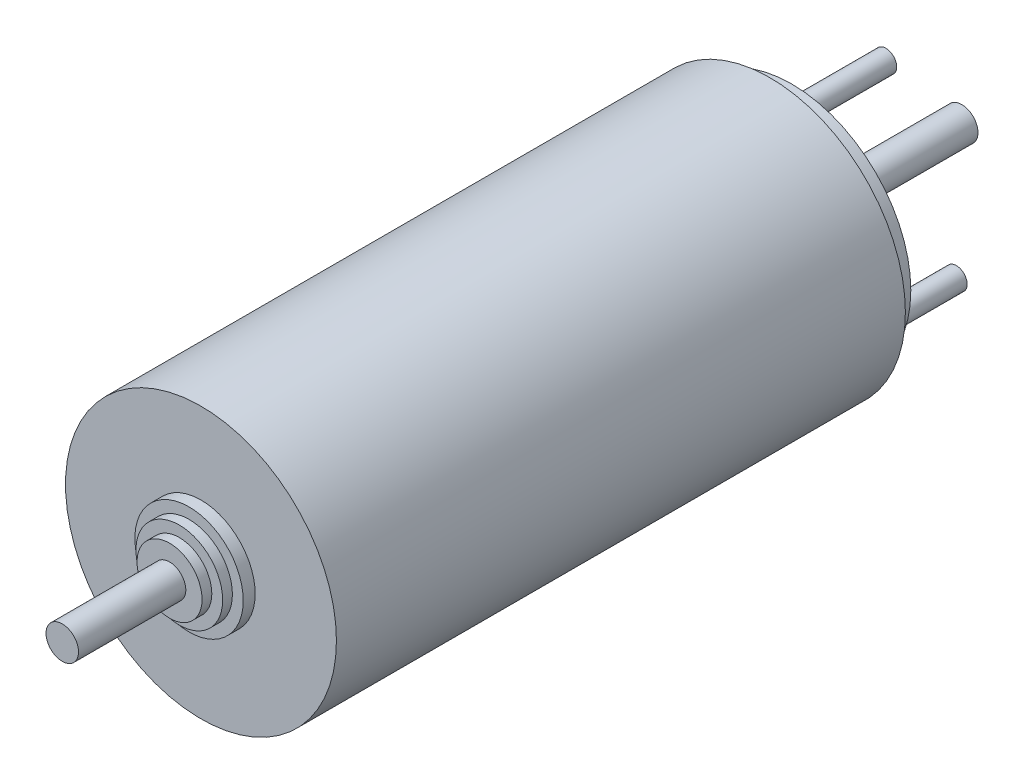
ISO-10303-21;
HEADER;
FILE_DESCRIPTION(('STEP AP214'),'2;1');
FILE_NAME('part.step','',(''),(''),'','','');
FILE_SCHEMA(('AUTOMOTIVE_DESIGN { 1 0 10303 214 1 1 1 1 }'));
ENDSEC;
DATA;
#1=APPLICATION_CONTEXT('core data for automotive mechanical design processes');
#2=APPLICATION_PROTOCOL_DEFINITION('international standard','automotive_design',2000,#1);
#3=PRODUCT_CONTEXT('',#1,'mechanical');
#4=PRODUCT('Part','Part','',(#3));
#5=PRODUCT_RELATED_PRODUCT_CATEGORY('part','',(#4));
#6=PRODUCT_DEFINITION_FORMATION('','',#4);
#7=PRODUCT_DEFINITION_CONTEXT('part definition',#1,'design');
#8=PRODUCT_DEFINITION('design','',#6,#7);
#9=PRODUCT_DEFINITION_SHAPE('','',#8);
#10=(LENGTH_UNIT() NAMED_UNIT(*) SI_UNIT(.MILLI.,.METRE.));
#11=(NAMED_UNIT(*) PLANE_ANGLE_UNIT() SI_UNIT($,.RADIAN.));
#12=(NAMED_UNIT(*) SI_UNIT($,.STERADIAN.) SOLID_ANGLE_UNIT());
#13=UNCERTAINTY_MEASURE_WITH_UNIT(LENGTH_MEASURE(1.E-05),#10,'distance_accuracy_value','');
#14=(GEOMETRIC_REPRESENTATION_CONTEXT(3) GLOBAL_UNCERTAINTY_ASSIGNED_CONTEXT((#13)) GLOBAL_UNIT_ASSIGNED_CONTEXT((#10,
#11,#12)) REPRESENTATION_CONTEXT('',''));
#15=CARTESIAN_POINT('',(0.,0.,0.));
#16=DIRECTION('',(0.,0.,1.));
#17=DIRECTION('',(1.,0.,0.));
#18=AXIS2_PLACEMENT_3D('',#15,#16,#17);
#19=CARTESIAN_POINT('',(-5.37038509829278,6.89725929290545,-2.));
#20=DIRECTION('',(0.,0.,-1.));
#21=DIRECTION('',(-1.,0.,0.));
#22=AXIS2_PLACEMENT_3D('',#19,#20,#21);
#23=PLANE('',#22);
#24=CARTESIAN_POINT('',(-11.8705642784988,1.28084960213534,-2.));
#25=DIRECTION('',(0.,0.,-1.));
#26=DIRECTION('',(-1.,0.,0.));
#27=AXIS2_PLACEMENT_3D('',#24,#25,#26);
#28=CIRCLE('',#27,1.);
#29=CARTESIAN_POINT('',(-12.8705642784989,1.28084960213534,-2.));
#30=VERTEX_POINT('',#29);
#31=EDGE_CURVE('E100',#30,#30,#28,.T.);
#32=ORIENTED_EDGE('',*,*,#31,.F.);
#33=EDGE_LOOP('',(#32));
#34=FACE_BOUND('',#33,.T.);
#35=CARTESIAN_POINT('',(-5.37038509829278,6.89725929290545,-2.));
#36=DIRECTION('',(0.,0.,-1.));
#37=DIRECTION('',(-1.,0.,0.));
#38=AXIS2_PLACEMENT_3D('',#35,#36,#37);
#39=CIRCLE('',#38,4.);
#40=CARTESIAN_POINT('',(-1.37038509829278,6.89725929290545,-2.));
#41=VERTEX_POINT('',#40);
#42=EDGE_CURVE('E76',#41,#41,#39,.T.);
#43=ORIENTED_EDGE('',*,*,#42,.F.);
#44=EDGE_LOOP('',(#43));
#45=FACE_BOUND('',#44,.T.);
#46=CARTESIAN_POINT('',(-5.37038509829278,6.89725929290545,-2.));
#47=DIRECTION('',(0.,0.,-1.));
#48=DIRECTION('',(-1.,0.,0.));
#49=AXIS2_PLACEMENT_3D('',#46,#47,#48);
#50=CIRCLE('',#49,11.);
#51=CARTESIAN_POINT('',(-16.3703850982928,6.89725929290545,-2.));
#52=VERTEX_POINT('',#51);
#53=EDGE_CURVE('E70',#52,#52,#50,.T.);
#54=ORIENTED_EDGE('',*,*,#53,.T.);
#55=EDGE_LOOP('',(#54));
#56=FACE_BOUND('',#55,.T.);
#57=CARTESIAN_POINT('',(-5.37056427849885,15.3972592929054,-2.));
#58=DIRECTION('',(0.,0.,-1.));
#59=DIRECTION('',(-1.,0.,0.));
#60=AXIS2_PLACEMENT_3D('',#57,#58,#59);
#61=CIRCLE('',#60,1.);
#62=CARTESIAN_POINT('',(-6.37056427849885,15.3972592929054,-2.));
#63=VERTEX_POINT('',#62);
#64=EDGE_CURVE('E94',#63,#63,#61,.T.);
#65=ORIENTED_EDGE('',*,*,#64,.F.);
#66=EDGE_LOOP('',(#65));
#67=FACE_BOUND('',#66,.T.);
#68=CARTESIAN_POINT('',(1.12943572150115,1.28084960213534,-2.));
#69=DIRECTION('',(0.,0.,-1.));
#70=DIRECTION('',(-1.,0.,0.));
#71=AXIS2_PLACEMENT_3D('',#68,#69,#70);
#72=CIRCLE('',#71,1.);
#73=CARTESIAN_POINT('',(0.129435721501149,1.28084960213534,-2.));
#74=VERTEX_POINT('',#73);
#75=EDGE_CURVE('E106',#74,#74,#72,.T.);
#76=ORIENTED_EDGE('',*,*,#75,.F.);
#77=EDGE_LOOP('',(#76));
#78=FACE_BOUND('',#77,.T.);
#79=ADVANCED_FACE('F31',(#34,#45,#56,#67,#78),#23,.T.);
#80=CARTESIAN_POINT('',(-5.37038509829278,6.89725929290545,-4.7));
#81=DIRECTION('',(0.,0.,-1.));
#82=DIRECTION('',(-1.,0.,0.));
#83=AXIS2_PLACEMENT_3D('',#80,#81,#82);
#84=PLANE('',#83);
#85=CARTESIAN_POINT('',(-5.37038509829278,6.89725929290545,-4.7));
#86=DIRECTION('',(0.,0.,-1.));
#87=DIRECTION('',(-1.,0.,0.));
#88=AXIS2_PLACEMENT_3D('',#85,#86,#87);
#89=CIRCLE('',#88,3.);
#90=CARTESIAN_POINT('',(-2.37038509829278,6.89725929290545,-4.7));
#91=VERTEX_POINT('',#90);
#92=EDGE_CURVE('E79',#91,#91,#89,.T.);
#93=ORIENTED_EDGE('',*,*,#92,.T.);
#94=EDGE_LOOP('',(#93));
#95=FACE_BOUND('',#94,.T.);
#96=CARTESIAN_POINT('',(-5.37038509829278,6.89725929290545,-4.7));
#97=DIRECTION('',(0.,0.,-1.));
#98=DIRECTION('',(-1.,0.,0.));
#99=AXIS2_PLACEMENT_3D('',#96,#97,#98);
#100=CIRCLE('',#99,1.5);
#101=CARTESIAN_POINT('',(-3.87038509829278,6.89725929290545,-4.7));
#102=VERTEX_POINT('',#101);
#103=EDGE_CURVE('E88',#102,#102,#100,.T.);
#104=ORIENTED_EDGE('',*,*,#103,.F.);
#105=EDGE_LOOP('',(#104));
#106=FACE_BOUND('',#105,.T.);
#107=ADVANCED_FACE('F122',(#95,#106),#84,.T.);
#108=CARTESIAN_POINT('',(-5.37038509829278,6.89725929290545,-3.35));
#109=DIRECTION('',(0.,0.,-1.));
#110=DIRECTION('',(-1.,0.,0.));
#111=AXIS2_PLACEMENT_3D('',#108,#109,#110);
#112=PLANE('',#111);
#113=CARTESIAN_POINT('',(-5.37038509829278,6.89725929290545,-3.35));
#114=DIRECTION('',(0.,0.,-1.));
#115=DIRECTION('',(-1.,0.,0.));
#116=AXIS2_PLACEMENT_3D('',#113,#114,#115);
#117=CIRCLE('',#116,4.);
#118=CARTESIAN_POINT('',(-1.37038509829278,6.89725929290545,-3.35));
#119=VERTEX_POINT('',#118);
#120=EDGE_CURVE('E75',#119,#119,#117,.T.);
#121=ORIENTED_EDGE('',*,*,#120,.T.);
#122=EDGE_LOOP('',(#121));
#123=FACE_BOUND('',#122,.T.);
#124=CARTESIAN_POINT('',(-5.37038509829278,6.89725929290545,-3.35));
#125=DIRECTION('',(0.,0.,-1.));
#126=DIRECTION('',(-1.,0.,0.));
#127=AXIS2_PLACEMENT_3D('',#124,#125,#126);
#128=CIRCLE('',#127,3.);
#129=CARTESIAN_POINT('',(-2.37038509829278,6.89725929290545,-3.35));
#130=VERTEX_POINT('',#129);
#131=EDGE_CURVE('E82',#130,#130,#128,.T.);
#132=ORIENTED_EDGE('',*,*,#131,.F.);
#133=EDGE_LOOP('',(#132));
#134=FACE_BOUND('',#133,.T.);
#135=ADVANCED_FACE('F128',(#123,#134),#112,.T.);
#136=CARTESIAN_POINT('',(-5.37038509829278,6.89725929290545,0.));
#137=DIRECTION('',(0.,0.,1.));
#138=DIRECTION('',(1.,0.,0.));
#139=AXIS2_PLACEMENT_3D('',#136,#137,#138);
#140=PLANE('',#139);
#141=CARTESIAN_POINT('',(-5.37038509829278,6.89725929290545,0.));
#142=DIRECTION('',(0.,0.,1.));
#143=DIRECTION('',(1.,0.,0.));
#144=AXIS2_PLACEMENT_3D('',#141,#142,#143);
#145=CIRCLE('',#144,12.5);
#146=CARTESIAN_POINT('',(7.12961490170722,6.89725929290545,0.));
#147=VERTEX_POINT('',#146);
#148=EDGE_CURVE('E42',#147,#147,#145,.T.);
#149=ORIENTED_EDGE('',*,*,#148,.F.);
#150=EDGE_LOOP('',(#149));
#151=FACE_BOUND('',#150,.T.);
#152=CARTESIAN_POINT('',(-5.37038509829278,6.89725929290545,0.));
#153=DIRECTION('',(0.,0.,1.));
#154=DIRECTION('',(1.,0.,0.));
#155=AXIS2_PLACEMENT_3D('',#152,#153,#154);
#156=CIRCLE('',#155,11.);
#157=CARTESIAN_POINT('',(5.62961490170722,6.89725929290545,0.));
#158=VERTEX_POINT('',#157);
#159=EDGE_CURVE('E10',#158,#158,#156,.F.);
#160=ORIENTED_EDGE('',*,*,#159,.F.);
#161=EDGE_LOOP('',(#160));
#162=FACE_BOUND('',#161,.T.);
#163=ADVANCED_FACE('F154',(#151,#162),#140,.F.);
#164=CARTESIAN_POINT('',(-5.37038509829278,6.89725929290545,55.4));
#165=DIRECTION('',(0.,0.,1.));
#166=DIRECTION('',(1.,0.,0.));
#167=AXIS2_PLACEMENT_3D('',#164,#165,#166);
#168=PLANE('',#167);
#169=CARTESIAN_POINT('',(-5.37038509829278,6.89725929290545,55.4));
#170=DIRECTION('',(0.,0.,1.));
#171=DIRECTION('',(1.,0.,0.));
#172=AXIS2_PLACEMENT_3D('',#169,#170,#171);
#173=CIRCLE('',#172,3.);
#174=CARTESIAN_POINT('',(-2.37038509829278,6.89725929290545,55.4));
#175=VERTEX_POINT('',#174);
#176=EDGE_CURVE('E58',#175,#175,#173,.T.);
#177=ORIENTED_EDGE('',*,*,#176,.T.);
#178=EDGE_LOOP('',(#177));
#179=FACE_BOUND('',#178,.T.);
#180=CARTESIAN_POINT('',(-5.37038509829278,6.89725929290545,55.4));
#181=DIRECTION('',(0.,0.,1.));
#182=DIRECTION('',(1.,0.,0.));
#183=AXIS2_PLACEMENT_3D('',#180,#181,#182);
#184=CIRCLE('',#183,1.5);
#185=CARTESIAN_POINT('',(-6.87038509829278,6.89725929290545,55.4));
#186=VERTEX_POINT('',#185);
#187=EDGE_CURVE('E67',#186,#186,#184,.T.);
#188=ORIENTED_EDGE('',*,*,#187,.F.);
#189=EDGE_LOOP('',(#188));
#190=FACE_BOUND('',#189,.T.);
#191=ADVANCED_FACE('F150',(#179,#190),#168,.T.);
#192=CARTESIAN_POINT('',(-5.37038509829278,6.89725929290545,54.5));
#193=DIRECTION('',(0.,0.,1.));
#194=DIRECTION('',(1.,0.,0.));
#195=AXIS2_PLACEMENT_3D('',#192,#193,#194);
#196=PLANE('',#195);
#197=CARTESIAN_POINT('',(-5.37038509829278,6.89725929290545,54.5));
#198=DIRECTION('',(0.,0.,1.));
#199=DIRECTION('',(1.,0.,0.));
#200=AXIS2_PLACEMENT_3D('',#197,#198,#199);
#201=CIRCLE('',#200,4.);
#202=CARTESIAN_POINT('',(-1.37038509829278,6.89725929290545,54.5));
#203=VERTEX_POINT('',#202);
#204=EDGE_CURVE('E52',#203,#203,#201,.T.);
#205=ORIENTED_EDGE('',*,*,#204,.T.);
#206=EDGE_LOOP('',(#205));
#207=FACE_BOUND('',#206,.T.);
#208=CARTESIAN_POINT('',(-5.37038509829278,6.89725929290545,54.5));
#209=DIRECTION('',(0.,0.,1.));
#210=DIRECTION('',(1.,0.,0.));
#211=AXIS2_PLACEMENT_3D('',#208,#209,#210);
#212=CIRCLE('',#211,3.);
#213=CARTESIAN_POINT('',(-2.37038509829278,6.89725929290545,54.5));
#214=VERTEX_POINT('',#213);
#215=EDGE_CURVE('E61',#214,#214,#212,.T.);
#216=ORIENTED_EDGE('',*,*,#215,.F.);
#217=EDGE_LOOP('',(#216));
#218=FACE_BOUND('',#217,.T.);
#219=ADVANCED_FACE('F153',(#207,#218),#196,.T.);
#220=CARTESIAN_POINT('',(-5.37038509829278,6.89725929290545,53.6));
#221=DIRECTION('',(0.,0.,1.));
#222=DIRECTION('',(1.,0.,0.));
#223=AXIS2_PLACEMENT_3D('',#220,#221,#222);
#224=PLANE('',#223);
#225=CARTESIAN_POINT('',(-5.37038509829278,6.89725929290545,53.6));
#226=DIRECTION('',(0.,0.,1.));
#227=DIRECTION('',(1.,0.,0.));
#228=AXIS2_PLACEMENT_3D('',#225,#226,#227);
#229=CIRCLE('',#228,5.);
#230=CARTESIAN_POINT('',(-0.370385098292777,6.89725929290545,53.6));
#231=VERTEX_POINT('',#230);
#232=EDGE_CURVE('E47',#231,#231,#229,.T.);
#233=ORIENTED_EDGE('',*,*,#232,.T.);
#234=EDGE_LOOP('',(#233));
#235=FACE_BOUND('',#234,.T.);
#236=CARTESIAN_POINT('',(-5.37038509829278,6.89725929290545,53.6));
#237=DIRECTION('',(0.,0.,1.));
#238=DIRECTION('',(1.,0.,0.));
#239=AXIS2_PLACEMENT_3D('',#236,#237,#238);
#240=CIRCLE('',#239,4.);
#241=CARTESIAN_POINT('',(-1.37038509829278,6.89725929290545,53.6));
#242=VERTEX_POINT('',#241);
#243=EDGE_CURVE('E55',#242,#242,#240,.T.);
#244=ORIENTED_EDGE('',*,*,#243,.F.);
#245=EDGE_LOOP('',(#244));
#246=FACE_BOUND('',#245,.T.);
#247=ADVANCED_FACE('F162',(#235,#246),#224,.T.);
#248=CARTESIAN_POINT('',(-5.37038509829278,6.89725929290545,52.5));
#249=DIRECTION('',(0.,0.,1.));
#250=DIRECTION('',(1.,0.,0.));
#251=AXIS2_PLACEMENT_3D('',#248,#249,#250);
#252=PLANE('',#251);
#253=CARTESIAN_POINT('',(-5.37038509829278,6.89725929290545,52.5));
#254=DIRECTION('',(0.,0.,1.));
#255=DIRECTION('',(1.,0.,0.));
#256=AXIS2_PLACEMENT_3D('',#253,#254,#255);
#257=CIRCLE('',#256,12.5);
#258=CARTESIAN_POINT('',(7.12961490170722,6.89725929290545,52.5));
#259=VERTEX_POINT('',#258);
#260=EDGE_CURVE('E38',#259,#259,#257,.T.);
#261=ORIENTED_EDGE('',*,*,#260,.T.);
#262=EDGE_LOOP('',(#261));
#263=FACE_BOUND('',#262,.T.);
#264=CARTESIAN_POINT('',(-5.37038509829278,6.89725929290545,52.5));
#265=DIRECTION('',(0.,0.,1.));
#266=DIRECTION('',(1.,0.,0.));
#267=AXIS2_PLACEMENT_3D('',#264,#265,#266);
#268=CIRCLE('',#267,5.);
#269=CARTESIAN_POINT('',(-0.370385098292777,6.89725929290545,52.5));
#270=VERTEX_POINT('',#269);
#271=EDGE_CURVE('E49',#270,#270,#268,.T.);
#272=ORIENTED_EDGE('',*,*,#271,.F.);
#273=EDGE_LOOP('',(#272));
#274=FACE_BOUND('',#273,.T.);
#275=ADVANCED_FACE('F170',(#263,#274),#252,.T.);
#276=CARTESIAN_POINT('',(-5.37038509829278,6.89725929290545,52.5));
#277=DIRECTION('',(0.,0.,-1.));
#278=DIRECTION('',(-1.,0.,0.));
#279=AXIS2_PLACEMENT_3D('',#276,#277,#278);
#280=CYLINDRICAL_SURFACE('',#279,12.5);
#281=ORIENTED_EDGE('',*,*,#260,.F.);
#282=EDGE_LOOP('',(#281));
#283=FACE_BOUND('',#282,.T.);
#284=ORIENTED_EDGE('',*,*,#148,.T.);
#285=EDGE_LOOP('',(#284));
#286=FACE_BOUND('',#285,.T.);
#287=ADVANCED_FACE('F33',(#283,#286),#280,.T.);
#288=CARTESIAN_POINT('',(-5.37038509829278,6.89725929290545,53.6));
#289=DIRECTION('',(0.,0.,-1.));
#290=DIRECTION('',(-1.,0.,0.));
#291=AXIS2_PLACEMENT_3D('',#288,#289,#290);
#292=CYLINDRICAL_SURFACE('',#291,5.);
#293=ORIENTED_EDGE('',*,*,#232,.F.);
#294=EDGE_LOOP('',(#293));
#295=FACE_BOUND('',#294,.T.);
#296=ORIENTED_EDGE('',*,*,#271,.T.);
#297=EDGE_LOOP('',(#296));
#298=FACE_BOUND('',#297,.T.);
#299=ADVANCED_FACE('F166',(#295,#298),#292,.T.);
#300=CARTESIAN_POINT('',(-5.37038509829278,6.89725929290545,54.5));
#301=DIRECTION('',(0.,0.,-1.));
#302=DIRECTION('',(-1.,0.,0.));
#303=AXIS2_PLACEMENT_3D('',#300,#301,#302);
#304=CYLINDRICAL_SURFACE('',#303,4.);
#305=ORIENTED_EDGE('',*,*,#204,.F.);
#306=EDGE_LOOP('',(#305));
#307=FACE_BOUND('',#306,.T.);
#308=ORIENTED_EDGE('',*,*,#243,.T.);
#309=EDGE_LOOP('',(#308));
#310=FACE_BOUND('',#309,.T.);
#311=ADVANCED_FACE('F158',(#307,#310),#304,.T.);
#312=CARTESIAN_POINT('',(-5.37038509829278,6.89725929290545,55.4));
#313=DIRECTION('',(0.,0.,-1.));
#314=DIRECTION('',(-1.,0.,0.));
#315=AXIS2_PLACEMENT_3D('',#312,#313,#314);
#316=CYLINDRICAL_SURFACE('',#315,3.);
#317=ORIENTED_EDGE('',*,*,#176,.F.);
#318=EDGE_LOOP('',(#317));
#319=FACE_BOUND('',#318,.T.);
#320=ORIENTED_EDGE('',*,*,#215,.T.);
#321=EDGE_LOOP('',(#320));
#322=FACE_BOUND('',#321,.T.);
#323=ADVANCED_FACE('F148',(#319,#322),#316,.T.);
#324=CARTESIAN_POINT('',(-5.37038509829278,6.89725929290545,65.3));
#325=DIRECTION('',(0.,0.,-1.));
#326=DIRECTION('',(-1.,0.,0.));
#327=AXIS2_PLACEMENT_3D('',#324,#325,#326);
#328=CYLINDRICAL_SURFACE('',#327,1.5);
#329=CARTESIAN_POINT('',(-5.37038509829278,6.89725929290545,65.3));
#330=DIRECTION('',(0.,0.,1.));
#331=DIRECTION('',(1.,0.,0.));
#332=AXIS2_PLACEMENT_3D('',#329,#330,#331);
#333=CIRCLE('',#332,1.5);
#334=CARTESIAN_POINT('',(-6.87038509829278,6.89725929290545,65.3));
#335=VERTEX_POINT('',#334);
#336=EDGE_CURVE('E64',#335,#335,#333,.T.);
#337=CARTESIAN_POINT('',(-6.87038509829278,6.89725929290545,65.3));
#338=CARTESIAN_POINT('',(-6.87038509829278,6.89725929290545,65.196875));
#339=CARTESIAN_POINT('',(-6.87038509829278,6.89725929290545,65.09375));
#340=CARTESIAN_POINT('',(-6.87038509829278,6.89725929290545,64.8875));
#341=CARTESIAN_POINT('',(-6.87038509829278,6.89725929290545,64.784375));
#342=CARTESIAN_POINT('',(-6.87038509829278,6.89725929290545,64.578125));
#343=CARTESIAN_POINT('',(-6.87038509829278,6.89725929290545,64.475));
#344=CARTESIAN_POINT('',(-6.87038509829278,6.89725929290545,64.26875));
#345=CARTESIAN_POINT('',(-6.87038509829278,6.89725929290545,64.165625));
#346=CARTESIAN_POINT('',(-6.87038509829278,6.89725929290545,63.959375));
#347=CARTESIAN_POINT('',(-6.87038509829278,6.89725929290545,63.85625));
#348=CARTESIAN_POINT('',(-6.87038509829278,6.89725929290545,63.65));
#349=CARTESIAN_POINT('',(-6.87038509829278,6.89725929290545,63.546875));
#350=CARTESIAN_POINT('',(-6.87038509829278,6.89725929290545,63.340625));
#351=CARTESIAN_POINT('',(-6.87038509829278,6.89725929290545,63.2375));
#352=CARTESIAN_POINT('',(-6.87038509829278,6.89725929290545,63.03125));
#353=CARTESIAN_POINT('',(-6.87038509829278,6.89725929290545,62.928125));
#354=CARTESIAN_POINT('',(-6.87038509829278,6.89725929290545,62.721875));
#355=CARTESIAN_POINT('',(-6.87038509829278,6.89725929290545,62.61875));
#356=CARTESIAN_POINT('',(-6.87038509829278,6.89725929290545,62.4125));
#357=CARTESIAN_POINT('',(-6.87038509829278,6.89725929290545,62.309375));
#358=CARTESIAN_POINT('',(-6.87038509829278,6.89725929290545,62.103125));
#359=CARTESIAN_POINT('',(-6.87038509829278,6.89725929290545,62.));
#360=CARTESIAN_POINT('',(-6.87038509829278,6.89725929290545,61.79375));
#361=CARTESIAN_POINT('',(-6.87038509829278,6.89725929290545,61.690625));
#362=CARTESIAN_POINT('',(-6.87038509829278,6.89725929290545,61.484375));
#363=CARTESIAN_POINT('',(-6.87038509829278,6.89725929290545,61.38125));
#364=CARTESIAN_POINT('',(-6.87038509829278,6.89725929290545,61.175));
#365=CARTESIAN_POINT('',(-6.87038509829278,6.89725929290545,61.071875));
#366=CARTESIAN_POINT('',(-6.87038509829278,6.89725929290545,60.865625));
#367=CARTESIAN_POINT('',(-6.87038509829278,6.89725929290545,60.7625));
#368=CARTESIAN_POINT('',(-6.87038509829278,6.89725929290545,60.55625));
#369=CARTESIAN_POINT('',(-6.87038509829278,6.89725929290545,60.453125));
#370=CARTESIAN_POINT('',(-6.87038509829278,6.89725929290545,60.246875));
#371=CARTESIAN_POINT('',(-6.87038509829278,6.89725929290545,60.14375));
#372=CARTESIAN_POINT('',(-6.87038509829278,6.89725929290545,59.9375));
#373=CARTESIAN_POINT('',(-6.87038509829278,6.89725929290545,59.834375));
#374=CARTESIAN_POINT('',(-6.87038509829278,6.89725929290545,59.628125));
#375=CARTESIAN_POINT('',(-6.87038509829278,6.89725929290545,59.525));
#376=CARTESIAN_POINT('',(-6.87038509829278,6.89725929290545,59.31875));
#377=CARTESIAN_POINT('',(-6.87038509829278,6.89725929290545,59.215625));
#378=CARTESIAN_POINT('',(-6.87038509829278,6.89725929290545,59.009375));
#379=CARTESIAN_POINT('',(-6.87038509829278,6.89725929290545,58.90625));
#380=CARTESIAN_POINT('',(-6.87038509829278,6.89725929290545,58.7));
#381=CARTESIAN_POINT('',(-6.87038509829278,6.89725929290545,58.596875));
#382=CARTESIAN_POINT('',(-6.87038509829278,6.89725929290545,58.390625));
#383=CARTESIAN_POINT('',(-6.87038509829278,6.89725929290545,58.2875));
#384=CARTESIAN_POINT('',(-6.87038509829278,6.89725929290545,58.08125));
#385=CARTESIAN_POINT('',(-6.87038509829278,6.89725929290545,57.978125));
#386=CARTESIAN_POINT('',(-6.87038509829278,6.89725929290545,57.771875));
#387=CARTESIAN_POINT('',(-6.87038509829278,6.89725929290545,57.66875));
#388=CARTESIAN_POINT('',(-6.87038509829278,6.89725929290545,57.4625));
#389=CARTESIAN_POINT('',(-6.87038509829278,6.89725929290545,57.359375));
#390=CARTESIAN_POINT('',(-6.87038509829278,6.89725929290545,57.153125));
#391=CARTESIAN_POINT('',(-6.87038509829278,6.89725929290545,57.05));
#392=CARTESIAN_POINT('',(-6.87038509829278,6.89725929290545,56.84375));
#393=CARTESIAN_POINT('',(-6.87038509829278,6.89725929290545,56.740625));
#394=CARTESIAN_POINT('',(-6.87038509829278,6.89725929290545,56.534375));
#395=CARTESIAN_POINT('',(-6.87038509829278,6.89725929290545,56.43125));
#396=CARTESIAN_POINT('',(-6.87038509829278,6.89725929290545,56.225));
#397=CARTESIAN_POINT('',(-6.87038509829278,6.89725929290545,56.121875));
#398=CARTESIAN_POINT('',(-6.87038509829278,6.89725929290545,55.915625));
#399=CARTESIAN_POINT('',(-6.87038509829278,6.89725929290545,55.8125));
#400=CARTESIAN_POINT('',(-6.87038509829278,6.89725929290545,55.60625));
#401=CARTESIAN_POINT('',(-6.87038509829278,6.89725929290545,55.503125));
#402=CARTESIAN_POINT('',(-6.87038509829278,6.89725929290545,55.4));
#403=B_SPLINE_CURVE_WITH_KNOTS('',3,(#337,#338,#339,#340,#341,#342,#343,#344,#345,#346,#347,
#348,#349,#350,#351,#352,#353,#354,#355,#356,#357,#358,#359,#360,#361,#362,#363,#364,#365,#366,
#367,#368,#369,#370,#371,#372,#373,#374,#375,#376,#377,#378,#379,#380,#381,#382,#383,#384,#385,
#386,#387,#388,#389,#390,#391,#392,#393,#394,#395,#396,#397,#398,#399,#400,#401,#402),
.UNSPECIFIED.,.F.,.F.,(4,2,2,2,2,2,2,2,2,2,2,2,2,2,2,2,2,2,2,2,2,2,2,2,2,2,2,2,2,2,2,2,4),(0.,
0.309374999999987,0.618749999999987,0.928124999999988,1.23749999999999,1.54687499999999,
1.85624999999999,2.16562499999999,2.47499999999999,2.78437499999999,3.09374999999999,
3.40312499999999,3.71249999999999,4.02187499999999,4.33124999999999,4.640625,4.95,5.259375,
5.56875,5.878125,6.1875,6.496875,6.80625,7.11562499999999,7.42499999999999,7.73437499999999,
8.04375,8.353125,8.6625,8.971875,9.28125,9.590625,9.9),.UNSPECIFIED.);
#404=EDGE_CURVE('BSEAM144',#335,#186,#403,.T.);
#405=ORIENTED_EDGE('',*,*,#336,.F.);
#406=ORIENTED_EDGE('',*,*,#187,.T.);
#407=ORIENTED_EDGE('',*,*,#404,.T.);
#408=ORIENTED_EDGE('',*,*,#404,.F.);
#409=EDGE_LOOP('',(#405,#407,#406,#408));
#410=FACE_BOUND('',#409,.T.);
#411=ADVANCED_FACE('F144',(#410),#328,.T.);
#412=CARTESIAN_POINT('',(-5.37038509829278,6.89725929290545,65.3));
#413=DIRECTION('',(0.,0.,1.));
#414=DIRECTION('',(1.,0.,0.));
#415=AXIS2_PLACEMENT_3D('',#412,#413,#414);
#416=PLANE('',#415);
#417=ORIENTED_EDGE('',*,*,#336,.T.);
#418=EDGE_LOOP('',(#417));
#419=FACE_BOUND('',#418,.T.);
#420=ADVANCED_FACE('F140',(#419),#416,.T.);
#421=CARTESIAN_POINT('',(-5.37038509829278,6.89725929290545,-2.));
#422=DIRECTION('',(0.,0.,1.));
#423=DIRECTION('',(1.,0.,0.));
#424=AXIS2_PLACEMENT_3D('',#421,#422,#423);
#425=CYLINDRICAL_SURFACE('',#424,11.);
#426=ORIENTED_EDGE('',*,*,#53,.F.);
#427=EDGE_LOOP('',(#426));
#428=FACE_BOUND('',#427,.T.);
#429=ORIENTED_EDGE('',*,*,#159,.T.);
#430=EDGE_LOOP('',(#429));
#431=FACE_BOUND('',#430,.T.);
#432=ADVANCED_FACE('F137',(#428,#431),#425,.T.);
#433=CARTESIAN_POINT('',(-5.37038509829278,6.89725929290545,-3.35));
#434=DIRECTION('',(0.,0.,1.));
#435=DIRECTION('',(1.,0.,0.));
#436=AXIS2_PLACEMENT_3D('',#433,#434,#435);
#437=CYLINDRICAL_SURFACE('',#436,4.);
#438=CARTESIAN_POINT('',(-1.37038509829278,6.89725929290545,-3.35));
#439=CARTESIAN_POINT('',(-1.37038509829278,6.89725929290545,-3.3359375));
#440=CARTESIAN_POINT('',(-1.37038509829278,6.89725929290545,-3.321875));
#441=CARTESIAN_POINT('',(-1.37038509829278,6.89725929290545,-3.29375));
#442=CARTESIAN_POINT('',(-1.37038509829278,6.89725929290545,-3.2796875));
#443=CARTESIAN_POINT('',(-1.37038509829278,6.89725929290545,-3.2515625));
#444=CARTESIAN_POINT('',(-1.37038509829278,6.89725929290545,-3.2375));
#445=CARTESIAN_POINT('',(-1.37038509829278,6.89725929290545,-3.209375));
#446=CARTESIAN_POINT('',(-1.37038509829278,6.89725929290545,-3.1953125));
#447=CARTESIAN_POINT('',(-1.37038509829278,6.89725929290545,-3.1671875));
#448=CARTESIAN_POINT('',(-1.37038509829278,6.89725929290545,-3.153125));
#449=CARTESIAN_POINT('',(-1.37038509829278,6.89725929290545,-3.125));
#450=CARTESIAN_POINT('',(-1.37038509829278,6.89725929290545,-3.1109375));
#451=CARTESIAN_POINT('',(-1.37038509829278,6.89725929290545,-3.0828125));
#452=CARTESIAN_POINT('',(-1.37038509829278,6.89725929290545,-3.06875));
#453=CARTESIAN_POINT('',(-1.37038509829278,6.89725929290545,-3.040625));
#454=CARTESIAN_POINT('',(-1.37038509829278,6.89725929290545,-3.0265625));
#455=CARTESIAN_POINT('',(-1.37038509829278,6.89725929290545,-2.9984375));
#456=CARTESIAN_POINT('',(-1.37038509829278,6.89725929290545,-2.984375));
#457=CARTESIAN_POINT('',(-1.37038509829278,6.89725929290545,-2.95625));
#458=CARTESIAN_POINT('',(-1.37038509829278,6.89725929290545,-2.9421875));
#459=CARTESIAN_POINT('',(-1.37038509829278,6.89725929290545,-2.9140625));
#460=CARTESIAN_POINT('',(-1.37038509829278,6.89725929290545,-2.9));
#461=CARTESIAN_POINT('',(-1.37038509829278,6.89725929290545,-2.871875));
#462=CARTESIAN_POINT('',(-1.37038509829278,6.89725929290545,-2.8578125));
#463=CARTESIAN_POINT('',(-1.37038509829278,6.89725929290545,-2.8296875));
#464=CARTESIAN_POINT('',(-1.37038509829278,6.89725929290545,-2.815625));
#465=CARTESIAN_POINT('',(-1.37038509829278,6.89725929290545,-2.7875));
#466=CARTESIAN_POINT('',(-1.37038509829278,6.89725929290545,-2.7734375));
#467=CARTESIAN_POINT('',(-1.37038509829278,6.89725929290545,-2.7453125));
#468=CARTESIAN_POINT('',(-1.37038509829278,6.89725929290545,-2.73125));
#469=CARTESIAN_POINT('',(-1.37038509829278,6.89725929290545,-2.703125));
#470=CARTESIAN_POINT('',(-1.37038509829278,6.89725929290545,-2.6890625));
#471=CARTESIAN_POINT('',(-1.37038509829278,6.89725929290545,-2.6609375));
#472=CARTESIAN_POINT('',(-1.37038509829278,6.89725929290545,-2.646875));
#473=CARTESIAN_POINT('',(-1.37038509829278,6.89725929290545,-2.61875));
#474=CARTESIAN_POINT('',(-1.37038509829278,6.89725929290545,-2.6046875));
#475=CARTESIAN_POINT('',(-1.37038509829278,6.89725929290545,-2.5765625));
#476=CARTESIAN_POINT('',(-1.37038509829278,6.89725929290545,-2.5625));
#477=CARTESIAN_POINT('',(-1.37038509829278,6.89725929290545,-2.534375));
#478=CARTESIAN_POINT('',(-1.37038509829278,6.89725929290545,-2.5203125));
#479=CARTESIAN_POINT('',(-1.37038509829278,6.89725929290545,-2.4921875));
#480=CARTESIAN_POINT('',(-1.37038509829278,6.89725929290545,-2.478125));
#481=CARTESIAN_POINT('',(-1.37038509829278,6.89725929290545,-2.45));
#482=CARTESIAN_POINT('',(-1.37038509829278,6.89725929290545,-2.4359375));
#483=CARTESIAN_POINT('',(-1.37038509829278,6.89725929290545,-2.4078125));
#484=CARTESIAN_POINT('',(-1.37038509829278,6.89725929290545,-2.39375));
#485=CARTESIAN_POINT('',(-1.37038509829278,6.89725929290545,-2.365625));
#486=CARTESIAN_POINT('',(-1.37038509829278,6.89725929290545,-2.3515625));
#487=CARTESIAN_POINT('',(-1.37038509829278,6.89725929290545,-2.3234375));
#488=CARTESIAN_POINT('',(-1.37038509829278,6.89725929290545,-2.309375));
#489=CARTESIAN_POINT('',(-1.37038509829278,6.89725929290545,-2.28125));
#490=CARTESIAN_POINT('',(-1.37038509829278,6.89725929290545,-2.2671875));
#491=CARTESIAN_POINT('',(-1.37038509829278,6.89725929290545,-2.2390625));
#492=CARTESIAN_POINT('',(-1.37038509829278,6.89725929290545,-2.225));
#493=CARTESIAN_POINT('',(-1.37038509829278,6.89725929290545,-2.196875));
#494=CARTESIAN_POINT('',(-1.37038509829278,6.89725929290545,-2.1828125));
#495=CARTESIAN_POINT('',(-1.37038509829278,6.89725929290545,-2.1546875));
#496=CARTESIAN_POINT('',(-1.37038509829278,6.89725929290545,-2.140625));
#497=CARTESIAN_POINT('',(-1.37038509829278,6.89725929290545,-2.1125));
#498=CARTESIAN_POINT('',(-1.37038509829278,6.89725929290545,-2.0984375));
#499=CARTESIAN_POINT('',(-1.37038509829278,6.89725929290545,-2.0703125));
#500=CARTESIAN_POINT('',(-1.37038509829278,6.89725929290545,-2.05625));
#501=CARTESIAN_POINT('',(-1.37038509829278,6.89725929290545,-2.028125));
#502=CARTESIAN_POINT('',(-1.37038509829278,6.89725929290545,-2.0140625));
#503=CARTESIAN_POINT('',(-1.37038509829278,6.89725929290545,-2.));
#504=B_SPLINE_CURVE_WITH_KNOTS('',3,(#438,#439,#440,#441,#442,#443,#444,#445,#446,#447,#448,
#449,#450,#451,#452,#453,#454,#455,#456,#457,#458,#459,#460,#461,#462,#463,#464,#465,#466,#467,
#468,#469,#470,#471,#472,#473,#474,#475,#476,#477,#478,#479,#480,#481,#482,#483,#484,#485,#486,
#487,#488,#489,#490,#491,#492,#493,#494,#495,#496,#497,#498,#499,#500,#501,#502,#503),
.UNSPECIFIED.,.F.,.F.,(4,2,2,2,2,2,2,2,2,2,2,2,2,2,2,2,2,2,2,2,2,2,2,2,2,2,2,2,2,2,2,2,4),(0.,
0.0421875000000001,0.0843750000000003,0.1265625,0.16875,0.2109375,0.253125,0.2953125,0.3375,
0.3796875,0.421875,0.4640625,0.50625,0.5484375,0.590625,0.6328125,0.675,0.7171875,0.759375,
0.8015625,0.84375,0.8859375,0.928125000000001,0.9703125,1.0125,1.0546875,1.096875,1.1390625,
1.18125,1.2234375,1.265625,1.3078125,1.35),.UNSPECIFIED.);
#505=EDGE_CURVE('BSEAM135',#119,#41,#504,.T.);
#506=ORIENTED_EDGE('',*,*,#120,.F.);
#507=ORIENTED_EDGE('',*,*,#42,.T.);
#508=ORIENTED_EDGE('',*,*,#505,.T.);
#509=ORIENTED_EDGE('',*,*,#505,.F.);
#510=EDGE_LOOP('',(#506,#508,#507,#509));
#511=FACE_BOUND('',#510,.T.);
#512=ADVANCED_FACE('F135',(#511),#437,.T.);
#513=CARTESIAN_POINT('',(-5.37038509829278,6.89725929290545,-4.7));
#514=DIRECTION('',(0.,0.,1.));
#515=DIRECTION('',(1.,0.,0.));
#516=AXIS2_PLACEMENT_3D('',#513,#514,#515);
#517=CYLINDRICAL_SURFACE('',#516,3.);
#518=CARTESIAN_POINT('',(-2.37038509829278,6.89725929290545,-4.7));
#519=CARTESIAN_POINT('',(-2.37038509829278,6.89725929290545,-4.6859375));
#520=CARTESIAN_POINT('',(-2.37038509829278,6.89725929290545,-4.671875));
#521=CARTESIAN_POINT('',(-2.37038509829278,6.89725929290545,-4.64375));
#522=CARTESIAN_POINT('',(-2.37038509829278,6.89725929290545,-4.6296875));
#523=CARTESIAN_POINT('',(-2.37038509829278,6.89725929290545,-4.6015625));
#524=CARTESIAN_POINT('',(-2.37038509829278,6.89725929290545,-4.5875));
#525=CARTESIAN_POINT('',(-2.37038509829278,6.89725929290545,-4.559375));
#526=CARTESIAN_POINT('',(-2.37038509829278,6.89725929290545,-4.5453125));
#527=CARTESIAN_POINT('',(-2.37038509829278,6.89725929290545,-4.5171875));
#528=CARTESIAN_POINT('',(-2.37038509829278,6.89725929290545,-4.503125));
#529=CARTESIAN_POINT('',(-2.37038509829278,6.89725929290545,-4.475));
#530=CARTESIAN_POINT('',(-2.37038509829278,6.89725929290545,-4.4609375));
#531=CARTESIAN_POINT('',(-2.37038509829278,6.89725929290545,-4.4328125));
#532=CARTESIAN_POINT('',(-2.37038509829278,6.89725929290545,-4.41875));
#533=CARTESIAN_POINT('',(-2.37038509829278,6.89725929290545,-4.390625));
#534=CARTESIAN_POINT('',(-2.37038509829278,6.89725929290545,-4.3765625));
#535=CARTESIAN_POINT('',(-2.37038509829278,6.89725929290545,-4.3484375));
#536=CARTESIAN_POINT('',(-2.37038509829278,6.89725929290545,-4.334375));
#537=CARTESIAN_POINT('',(-2.37038509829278,6.89725929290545,-4.30625));
#538=CARTESIAN_POINT('',(-2.37038509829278,6.89725929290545,-4.2921875));
#539=CARTESIAN_POINT('',(-2.37038509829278,6.89725929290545,-4.2640625));
#540=CARTESIAN_POINT('',(-2.37038509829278,6.89725929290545,-4.25));
#541=CARTESIAN_POINT('',(-2.37038509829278,6.89725929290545,-4.221875));
#542=CARTESIAN_POINT('',(-2.37038509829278,6.89725929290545,-4.2078125));
#543=CARTESIAN_POINT('',(-2.37038509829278,6.89725929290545,-4.1796875));
#544=CARTESIAN_POINT('',(-2.37038509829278,6.89725929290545,-4.165625));
#545=CARTESIAN_POINT('',(-2.37038509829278,6.89725929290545,-4.1375));
#546=CARTESIAN_POINT('',(-2.37038509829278,6.89725929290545,-4.1234375));
#547=CARTESIAN_POINT('',(-2.37038509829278,6.89725929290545,-4.0953125));
#548=CARTESIAN_POINT('',(-2.37038509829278,6.89725929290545,-4.08125));
#549=CARTESIAN_POINT('',(-2.37038509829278,6.89725929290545,-4.053125));
#550=CARTESIAN_POINT('',(-2.37038509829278,6.89725929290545,-4.0390625));
#551=CARTESIAN_POINT('',(-2.37038509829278,6.89725929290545,-4.0109375));
#552=CARTESIAN_POINT('',(-2.37038509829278,6.89725929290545,-3.996875));
#553=CARTESIAN_POINT('',(-2.37038509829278,6.89725929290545,-3.96875));
#554=CARTESIAN_POINT('',(-2.37038509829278,6.89725929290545,-3.9546875));
#555=CARTESIAN_POINT('',(-2.37038509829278,6.89725929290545,-3.9265625));
#556=CARTESIAN_POINT('',(-2.37038509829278,6.89725929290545,-3.9125));
#557=CARTESIAN_POINT('',(-2.37038509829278,6.89725929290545,-3.884375));
#558=CARTESIAN_POINT('',(-2.37038509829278,6.89725929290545,-3.8703125));
#559=CARTESIAN_POINT('',(-2.37038509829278,6.89725929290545,-3.8421875));
#560=CARTESIAN_POINT('',(-2.37038509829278,6.89725929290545,-3.828125));
#561=CARTESIAN_POINT('',(-2.37038509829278,6.89725929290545,-3.8));
#562=CARTESIAN_POINT('',(-2.37038509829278,6.89725929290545,-3.7859375));
#563=CARTESIAN_POINT('',(-2.37038509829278,6.89725929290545,-3.7578125));
#564=CARTESIAN_POINT('',(-2.37038509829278,6.89725929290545,-3.74375));
#565=CARTESIAN_POINT('',(-2.37038509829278,6.89725929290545,-3.715625));
#566=CARTESIAN_POINT('',(-2.37038509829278,6.89725929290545,-3.7015625));
#567=CARTESIAN_POINT('',(-2.37038509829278,6.89725929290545,-3.6734375));
#568=CARTESIAN_POINT('',(-2.37038509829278,6.89725929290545,-3.659375));
#569=CARTESIAN_POINT('',(-2.37038509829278,6.89725929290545,-3.63125));
#570=CARTESIAN_POINT('',(-2.37038509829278,6.89725929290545,-3.6171875));
#571=CARTESIAN_POINT('',(-2.37038509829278,6.89725929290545,-3.5890625));
#572=CARTESIAN_POINT('',(-2.37038509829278,6.89725929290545,-3.575));
#573=CARTESIAN_POINT('',(-2.37038509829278,6.89725929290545,-3.546875));
#574=CARTESIAN_POINT('',(-2.37038509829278,6.89725929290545,-3.5328125));
#575=CARTESIAN_POINT('',(-2.37038509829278,6.89725929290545,-3.5046875));
#576=CARTESIAN_POINT('',(-2.37038509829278,6.89725929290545,-3.490625));
#577=CARTESIAN_POINT('',(-2.37038509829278,6.89725929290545,-3.4625));
#578=CARTESIAN_POINT('',(-2.37038509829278,6.89725929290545,-3.4484375));
#579=CARTESIAN_POINT('',(-2.37038509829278,6.89725929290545,-3.4203125));
#580=CARTESIAN_POINT('',(-2.37038509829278,6.89725929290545,-3.40625));
#581=CARTESIAN_POINT('',(-2.37038509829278,6.89725929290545,-3.378125));
#582=CARTESIAN_POINT('',(-2.37038509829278,6.89725929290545,-3.3640625));
#583=CARTESIAN_POINT('',(-2.37038509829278,6.89725929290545,-3.35));
#584=B_SPLINE_CURVE_WITH_KNOTS('',3,(#518,#519,#520,#521,#522,#523,#524,#525,#526,#527,#528,
#529,#530,#531,#532,#533,#534,#535,#536,#537,#538,#539,#540,#541,#542,#543,#544,#545,#546,#547,
#548,#549,#550,#551,#552,#553,#554,#555,#556,#557,#558,#559,#560,#561,#562,#563,#564,#565,#566,
#567,#568,#569,#570,#571,#572,#573,#574,#575,#576,#577,#578,#579,#580,#581,#582,#583),
.UNSPECIFIED.,.F.,.F.,(4,2,2,2,2,2,2,2,2,2,2,2,2,2,2,2,2,2,2,2,2,2,2,2,2,2,2,2,2,2,2,2,4),(0.,
0.0421875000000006,0.0843750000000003,0.126562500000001,0.168750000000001,0.2109375,
0.253125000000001,0.2953125,0.3375,0.379687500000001,0.421875,0.4640625,0.506250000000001,
0.5484375,0.590625,0.632812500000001,0.675,0.7171875,0.759375,0.8015625,0.84375,0.8859375,
0.928125,0.9703125,1.0125,1.0546875,1.096875,1.1390625,1.18125,1.2234375,1.265625,1.3078125,
1.35),.UNSPECIFIED.);
#585=EDGE_CURVE('BSEAM224',#91,#130,#584,.T.);
#586=ORIENTED_EDGE('',*,*,#92,.F.);
#587=ORIENTED_EDGE('',*,*,#131,.T.);
#588=ORIENTED_EDGE('',*,*,#585,.T.);
#589=ORIENTED_EDGE('',*,*,#585,.F.);
#590=EDGE_LOOP('',(#586,#588,#587,#589));
#591=FACE_BOUND('',#590,.T.);
#592=ADVANCED_FACE('F224',(#591),#517,.T.);
#593=CARTESIAN_POINT('',(-5.37038509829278,6.89725929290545,-17.7));
#594=DIRECTION('',(0.,0.,1.));
#595=DIRECTION('',(1.,0.,0.));
#596=AXIS2_PLACEMENT_3D('',#593,#594,#595);
#597=CYLINDRICAL_SURFACE('',#596,1.5);
#598=CARTESIAN_POINT('',(-5.37038509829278,6.89725929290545,-17.7));
#599=DIRECTION('',(0.,0.,-1.));
#600=DIRECTION('',(-1.,0.,0.));
#601=AXIS2_PLACEMENT_3D('',#598,#599,#600);
#602=CIRCLE('',#601,1.5);
#603=CARTESIAN_POINT('',(-3.87038509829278,6.89725929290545,-17.7));
#604=VERTEX_POINT('',#603);
#605=EDGE_CURVE('E85',#604,#604,#602,.T.);
#606=CARTESIAN_POINT('',(-3.87038509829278,6.89725929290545,-17.7));
#607=CARTESIAN_POINT('',(-3.87038509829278,6.89725929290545,-17.5645833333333));
#608=CARTESIAN_POINT('',(-3.87038509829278,6.89725929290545,-17.4291666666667));
#609=CARTESIAN_POINT('',(-3.87038509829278,6.89725929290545,-17.1583333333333));
#610=CARTESIAN_POINT('',(-3.87038509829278,6.89725929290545,-17.0229166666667));
#611=CARTESIAN_POINT('',(-3.87038509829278,6.89725929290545,-16.7520833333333));
#612=CARTESIAN_POINT('',(-3.87038509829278,6.89725929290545,-16.6166666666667));
#613=CARTESIAN_POINT('',(-3.87038509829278,6.89725929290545,-16.3458333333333));
#614=CARTESIAN_POINT('',(-3.87038509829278,6.89725929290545,-16.2104166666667));
#615=CARTESIAN_POINT('',(-3.87038509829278,6.89725929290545,-15.9395833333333));
#616=CARTESIAN_POINT('',(-3.87038509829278,6.89725929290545,-15.8041666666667));
#617=CARTESIAN_POINT('',(-3.87038509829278,6.89725929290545,-15.5333333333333));
#618=CARTESIAN_POINT('',(-3.87038509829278,6.89725929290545,-15.3979166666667));
#619=CARTESIAN_POINT('',(-3.87038509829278,6.89725929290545,-15.1270833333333));
#620=CARTESIAN_POINT('',(-3.87038509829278,6.89725929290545,-14.9916666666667));
#621=CARTESIAN_POINT('',(-3.87038509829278,6.89725929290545,-14.7208333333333));
#622=CARTESIAN_POINT('',(-3.87038509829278,6.89725929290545,-14.5854166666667));
#623=CARTESIAN_POINT('',(-3.87038509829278,6.89725929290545,-14.3145833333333));
#624=CARTESIAN_POINT('',(-3.87038509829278,6.89725929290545,-14.1791666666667));
#625=CARTESIAN_POINT('',(-3.87038509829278,6.89725929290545,-13.9083333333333));
#626=CARTESIAN_POINT('',(-3.87038509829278,6.89725929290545,-13.7729166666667));
#627=CARTESIAN_POINT('',(-3.87038509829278,6.89725929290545,-13.5020833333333));
#628=CARTESIAN_POINT('',(-3.87038509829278,6.89725929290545,-13.3666666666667));
#629=CARTESIAN_POINT('',(-3.87038509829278,6.89725929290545,-13.0958333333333));
#630=CARTESIAN_POINT('',(-3.87038509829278,6.89725929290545,-12.9604166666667));
#631=CARTESIAN_POINT('',(-3.87038509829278,6.89725929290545,-12.6895833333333));
#632=CARTESIAN_POINT('',(-3.87038509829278,6.89725929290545,-12.5541666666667));
#633=CARTESIAN_POINT('',(-3.87038509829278,6.89725929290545,-12.2833333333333));
#634=CARTESIAN_POINT('',(-3.87038509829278,6.89725929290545,-12.1479166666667));
#635=CARTESIAN_POINT('',(-3.87038509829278,6.89725929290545,-11.8770833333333));
#636=CARTESIAN_POINT('',(-3.87038509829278,6.89725929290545,-11.7416666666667));
#637=CARTESIAN_POINT('',(-3.87038509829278,6.89725929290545,-11.4708333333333));
#638=CARTESIAN_POINT('',(-3.87038509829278,6.89725929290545,-11.3354166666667));
#639=CARTESIAN_POINT('',(-3.87038509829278,6.89725929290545,-11.0645833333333));
#640=CARTESIAN_POINT('',(-3.87038509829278,6.89725929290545,-10.9291666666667));
#641=CARTESIAN_POINT('',(-3.87038509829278,6.89725929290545,-10.6583333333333));
#642=CARTESIAN_POINT('',(-3.87038509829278,6.89725929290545,-10.5229166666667));
#643=CARTESIAN_POINT('',(-3.87038509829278,6.89725929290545,-10.2520833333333));
#644=CARTESIAN_POINT('',(-3.87038509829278,6.89725929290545,-10.1166666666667));
#645=CARTESIAN_POINT('',(-3.87038509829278,6.89725929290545,-9.84583333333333));
#646=CARTESIAN_POINT('',(-3.87038509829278,6.89725929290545,-9.71041666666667));
#647=CARTESIAN_POINT('',(-3.87038509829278,6.89725929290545,-9.43958333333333));
#648=CARTESIAN_POINT('',(-3.87038509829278,6.89725929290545,-9.30416666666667));
#649=CARTESIAN_POINT('',(-3.87038509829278,6.89725929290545,-9.03333333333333));
#650=CARTESIAN_POINT('',(-3.87038509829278,6.89725929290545,-8.89791666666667));
#651=CARTESIAN_POINT('',(-3.87038509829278,6.89725929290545,-8.62708333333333));
#652=CARTESIAN_POINT('',(-3.87038509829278,6.89725929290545,-8.49166666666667));
#653=CARTESIAN_POINT('',(-3.87038509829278,6.89725929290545,-8.22083333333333));
#654=CARTESIAN_POINT('',(-3.87038509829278,6.89725929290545,-8.08541666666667));
#655=CARTESIAN_POINT('',(-3.87038509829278,6.89725929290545,-7.81458333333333));
#656=CARTESIAN_POINT('',(-3.87038509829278,6.89725929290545,-7.67916666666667));
#657=CARTESIAN_POINT('',(-3.87038509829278,6.89725929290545,-7.40833333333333));
#658=CARTESIAN_POINT('',(-3.87038509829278,6.89725929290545,-7.27291666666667));
#659=CARTESIAN_POINT('',(-3.87038509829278,6.89725929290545,-7.00208333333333));
#660=CARTESIAN_POINT('',(-3.87038509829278,6.89725929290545,-6.86666666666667));
#661=CARTESIAN_POINT('',(-3.87038509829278,6.89725929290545,-6.59583333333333));
#662=CARTESIAN_POINT('',(-3.87038509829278,6.89725929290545,-6.46041666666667));
#663=CARTESIAN_POINT('',(-3.87038509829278,6.89725929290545,-6.18958333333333));
#664=CARTESIAN_POINT('',(-3.87038509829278,6.89725929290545,-6.05416666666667));
#665=CARTESIAN_POINT('',(-3.87038509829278,6.89725929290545,-5.78333333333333));
#666=CARTESIAN_POINT('',(-3.87038509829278,6.89725929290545,-5.64791666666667));
#667=CARTESIAN_POINT('',(-3.87038509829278,6.89725929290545,-5.37708333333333));
#668=CARTESIAN_POINT('',(-3.87038509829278,6.89725929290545,-5.24166666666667));
#669=CARTESIAN_POINT('',(-3.87038509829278,6.89725929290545,-4.97083333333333));
#670=CARTESIAN_POINT('',(-3.87038509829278,6.89725929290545,-4.83541666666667));
#671=CARTESIAN_POINT('',(-3.87038509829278,6.89725929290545,-4.7));
#672=B_SPLINE_CURVE_WITH_KNOTS('',3,(#606,#607,#608,#609,#610,#611,#612,#613,#614,#615,#616,
#617,#618,#619,#620,#621,#622,#623,#624,#625,#626,#627,#628,#629,#630,#631,#632,#633,#634,#635,
#636,#637,#638,#639,#640,#641,#642,#643,#644,#645,#646,#647,#648,#649,#650,#651,#652,#653,#654,
#655,#656,#657,#658,#659,#660,#661,#662,#663,#664,#665,#666,#667,#668,#669,#670,#671),
.UNSPECIFIED.,.F.,.F.,(4,2,2,2,2,2,2,2,2,2,2,2,2,2,2,2,2,2,2,2,2,2,2,2,2,2,2,2,2,2,2,2,4),(0.,
0.406249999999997,0.812499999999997,1.21875,1.625,2.03125,2.4375,2.84375,3.25,3.65625,4.0625,
4.46875,4.875,5.28125,5.6875,6.09375,6.5,6.90625,7.3125,7.71875,8.125,8.53124999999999,8.9375,
9.34375,9.75,10.15625,10.5625,10.96875,11.375,11.78125,12.1875,12.59375,13.),.UNSPECIFIED.);
#673=EDGE_CURVE('BSEAM232',#604,#102,#672,.T.);
#674=ORIENTED_EDGE('',*,*,#605,.F.);
#675=ORIENTED_EDGE('',*,*,#103,.T.);
#676=ORIENTED_EDGE('',*,*,#673,.T.);
#677=ORIENTED_EDGE('',*,*,#673,.F.);
#678=EDGE_LOOP('',(#674,#676,#675,#677));
#679=FACE_BOUND('',#678,.T.);
#680=ADVANCED_FACE('F232',(#679),#597,.T.);
#681=CARTESIAN_POINT('',(-5.37038509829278,6.89725929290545,-17.7));
#682=DIRECTION('',(0.,0.,-1.));
#683=DIRECTION('',(-1.,0.,0.));
#684=AXIS2_PLACEMENT_3D('',#681,#682,#683);
#685=PLANE('',#684);
#686=ORIENTED_EDGE('',*,*,#605,.T.);
#687=EDGE_LOOP('',(#686));
#688=FACE_BOUND('',#687,.T.);
#689=ADVANCED_FACE('F241',(#688),#685,.T.);
#690=CARTESIAN_POINT('',(-5.37056427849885,15.3972592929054,-10.7));
#691=DIRECTION('',(0.,0.,1.));
#692=DIRECTION('',(1.,0.,0.));
#693=AXIS2_PLACEMENT_3D('',#690,#691,#692);
#694=CYLINDRICAL_SURFACE('',#693,1.);
#695=CARTESIAN_POINT('',(-5.37056427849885,15.3972592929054,-10.7));
#696=DIRECTION('',(0.,0.,-1.));
#697=DIRECTION('',(-1.,0.,0.));
#698=AXIS2_PLACEMENT_3D('',#695,#696,#697);
#699=CIRCLE('',#698,1.);
#700=CARTESIAN_POINT('',(-6.37056427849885,15.3972592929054,-10.7));
#701=VERTEX_POINT('',#700);
#702=EDGE_CURVE('E91',#701,#701,#699,.T.);
#703=ORIENTED_EDGE('',*,*,#702,.F.);
#704=EDGE_LOOP('',(#703));
#705=FACE_BOUND('',#704,.T.);
#706=ORIENTED_EDGE('',*,*,#64,.T.);
#707=EDGE_LOOP('',(#706));
#708=FACE_BOUND('',#707,.T.);
#709=ADVANCED_FACE('F249',(#705,#708),#694,.T.);
#710=CARTESIAN_POINT('',(-5.37056427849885,15.3972592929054,-10.7));
#711=DIRECTION('',(0.,0.,-1.));
#712=DIRECTION('',(-1.,0.,0.));
#713=AXIS2_PLACEMENT_3D('',#710,#711,#712);
#714=PLANE('',#713);
#715=ORIENTED_EDGE('',*,*,#702,.T.);
#716=EDGE_LOOP('',(#715));
#717=FACE_BOUND('',#716,.T.);
#718=ADVANCED_FACE('F257',(#717),#714,.T.);
#719=CARTESIAN_POINT('',(-11.8705642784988,1.28084960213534,-10.7));
#720=DIRECTION('',(0.,0.,1.));
#721=DIRECTION('',(1.,0.,0.));
#722=AXIS2_PLACEMENT_3D('',#719,#720,#721);
#723=CYLINDRICAL_SURFACE('',#722,1.);
#724=CARTESIAN_POINT('',(-11.8705642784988,1.28084960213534,-10.7));
#725=DIRECTION('',(0.,0.,-1.));
#726=DIRECTION('',(-1.,0.,0.));
#727=AXIS2_PLACEMENT_3D('',#724,#725,#726);
#728=CIRCLE('',#727,1.);
#729=CARTESIAN_POINT('',(-12.8705642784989,1.28084960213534,-10.7));
#730=VERTEX_POINT('',#729);
#731=EDGE_CURVE('E97',#730,#730,#728,.T.);
#732=ORIENTED_EDGE('',*,*,#731,.F.);
#733=EDGE_LOOP('',(#732));
#734=FACE_BOUND('',#733,.T.);
#735=ORIENTED_EDGE('',*,*,#31,.T.);
#736=EDGE_LOOP('',(#735));
#737=FACE_BOUND('',#736,.T.);
#738=ADVANCED_FACE('F265',(#734,#737),#723,.T.);
#739=CARTESIAN_POINT('',(-11.8705642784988,1.28084960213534,-10.7));
#740=DIRECTION('',(0.,0.,-1.));
#741=DIRECTION('',(-1.,0.,0.));
#742=AXIS2_PLACEMENT_3D('',#739,#740,#741);
#743=PLANE('',#742);
#744=ORIENTED_EDGE('',*,*,#731,.T.);
#745=EDGE_LOOP('',(#744));
#746=FACE_BOUND('',#745,.T.);
#747=ADVANCED_FACE('F117',(#746),#743,.T.);
#748=CARTESIAN_POINT('',(1.12943572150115,1.28084960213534,-10.7));
#749=DIRECTION('',(0.,0.,1.));
#750=DIRECTION('',(1.,0.,0.));
#751=AXIS2_PLACEMENT_3D('',#748,#749,#750);
#752=CYLINDRICAL_SURFACE('',#751,1.);
#753=CARTESIAN_POINT('',(1.12943572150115,1.28084960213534,-10.7));
#754=DIRECTION('',(0.,0.,-1.));
#755=DIRECTION('',(-1.,0.,0.));
#756=AXIS2_PLACEMENT_3D('',#753,#754,#755);
#757=CIRCLE('',#756,1.);
#758=CARTESIAN_POINT('',(0.129435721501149,1.28084960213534,-10.7));
#759=VERTEX_POINT('',#758);
#760=EDGE_CURVE('E103',#759,#759,#757,.T.);
#761=ORIENTED_EDGE('',*,*,#760,.F.);
#762=EDGE_LOOP('',(#761));
#763=FACE_BOUND('',#762,.T.);
#764=ORIENTED_EDGE('',*,*,#75,.T.);
#765=EDGE_LOOP('',(#764));
#766=FACE_BOUND('',#765,.T.);
#767=ADVANCED_FACE('F114',(#763,#766),#752,.T.);
#768=CARTESIAN_POINT('',(1.12943572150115,1.28084960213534,-10.7));
#769=DIRECTION('',(0.,0.,-1.));
#770=DIRECTION('',(-1.,0.,0.));
#771=AXIS2_PLACEMENT_3D('',#768,#769,#770);
#772=PLANE('',#771);
#773=ORIENTED_EDGE('',*,*,#760,.T.);
#774=EDGE_LOOP('',(#773));
#775=FACE_BOUND('',#774,.T.);
#776=ADVANCED_FACE('F112',(#775),#772,.T.);
#777=CLOSED_SHELL('',(#79,#107,#135,#163,#191,#219,#247,#275,#287,#299,#311,#323,#411,#420,#432,
#512,#592,#680,#689,#709,#718,#738,#747,#767,#776));
#778=MANIFOLD_SOLID_BREP('B2',#777);
#779=ADVANCED_BREP_SHAPE_REPRESENTATION('',(#18,#778),#14);
#780=SHAPE_DEFINITION_REPRESENTATION(#9,#779);
ENDSEC;
END-ISO-10303-21;
